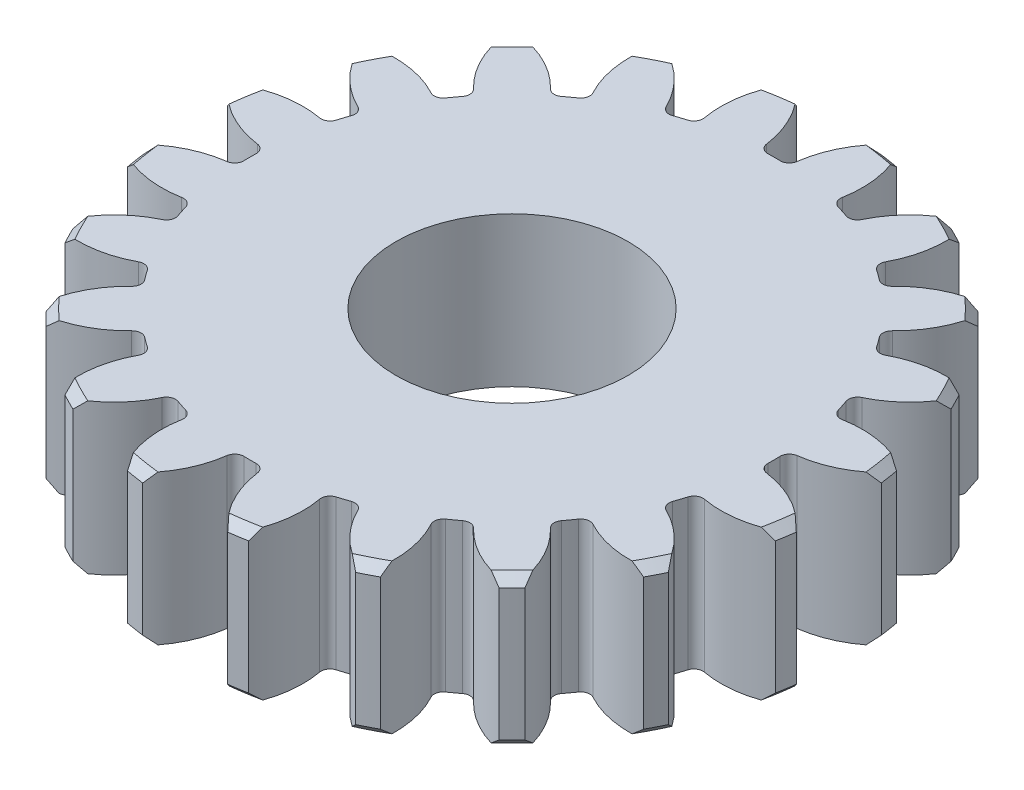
from build123d import *

# Parameters (mm, degrees)
SKETCH1_R                = 22
BOSS_EXTRUDE1_DEPTH      = 10
CUT_EXTRUDE1_DEPTH       = 10
FILLET1_R                = 0.6
CHAMFER1_SIZE            = 0.6
CIRPATTERN1_COUNT        = 20
FILLET1_OF_CIRPATTERN1_R = 0.6
SKETCH3_R                = 7.75
CUT_EXTRUDE2_DEPTH       = 10


with BuildPart() as part:
    # Sketch1 → Boss-Extrude1 (new body)
    with BuildSketch(Plane(origin=(0, 0, 0), x_dir=(1, 0, 0), z_dir=(0, 1, 0))):
        with Locations(Location((0, 0, 0), (0, 0, 270))):
            Circle(SKETCH1_R)
    extrude(amount=BOSS_EXTRUDE1_DEPTH)

    # Sketch2 → Cut-Extrude1 (cut)
    with BuildSketch(Plane.XZ):
        with BuildLine():
            ThreePointArc((-2.83665719, 21.816355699), (-1.513028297, 19.811754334), (-0.962550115, 17.473508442))
            ThreePointArc((-0.962550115, 17.473508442), (0, 17.5), (0.962550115, 17.473508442))
            ThreePointArc((0.962550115, 17.473508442), (1.513028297, 19.811754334), (2.83665719, 21.816355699))
            ThreePointArc((2.83665719, 21.816355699), (0, 22), (-2.83665719, 21.816355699))
        make_face()
    cut_extrude1 = extrude(amount=-CUT_EXTRUDE1_DEPTH, mode=Mode.SUBTRACT)

    # Fillet1
    fillet1_edges = [part.edges().sort_by_distance(p)[0] for p in [
        (-0.962550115, 5, 17.473508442),
        (0.962550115, 5, 17.473508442),
    ]]
    fillet(fillet1_edges, radius=FILLET1_R)

    # Chamfer1
    chamfer1_edges = [part.edges().sort_by_distance(p)[0] for p in [
        (0, 0, -22),
        (0, 10, -22),
    ]]
    chamfer(chamfer1_edges, length=CHAMFER1_SIZE)

    # CirPattern1: Cut-Extrude1 ×20 about axis
    cirpattern1_axis = Axis((0, 0, 0), (0, 1, 0))
    for i in range(1, CIRPATTERN1_COUNT):
        add(cut_extrude1.rotate(cirpattern1_axis, i * 360 / CIRPATTERN1_COUNT), mode=Mode.SUBTRACT)

    # Fillet1 of CirPattern1
    fillet1_of_cirpattern1_edges = [part.edges().sort_by_distance(p)[0] for p in [
        (4.4841715, 5, 16.91573841),
        (6.31505062, 5, 16.320849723),
        (9.491951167, 5, 14.702138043),
        (11.049389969, 5, 13.570592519),
        (13.570592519, 5, 11.049389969),
        (14.702138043, 5, 9.491951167),
        (16.320849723, 5, 6.31505062),
        (16.91573841, 5, 4.4841715),
        (17.473508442, 5, 0.962550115),
        (17.473508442, 5, -0.962550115),
        (16.91573841, 5, -4.4841715),
        (16.320849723, 5, -6.31505062),
        (14.702138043, 5, -9.491951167),
        (13.570592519, 5, -11.049389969),
        (11.049389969, 5, -13.570592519),
        (9.491951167, 5, -14.702138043),
        (6.31505062, 5, -16.320849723),
        (4.4841715, 5, -16.91573841),
        (0.962550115, 5, -17.473508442),
        (-0.962550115, 5, -17.473508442),
        (-4.4841715, 5, -16.91573841),
        (-6.31505062, 5, -16.320849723),
        (-9.491951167, 5, -14.702138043),
        (-11.049389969, 5, -13.570592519),
        (-13.570592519, 5, -11.049389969),
        (-14.702138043, 5, -9.491951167),
        (-16.320849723, 5, -6.31505062),
        (-16.91573841, 5, -4.4841715),
        (-17.473508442, 5, -0.962550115),
        (-17.473508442, 5, 0.962550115),
        (-16.91573841, 5, 4.4841715),
        (-16.320849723, 5, 6.31505062),
        (-14.702138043, 5, 9.491951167),
        (-13.570592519, 5, 11.049389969),
        (-11.049389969, 5, 13.570592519),
        (-9.491951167, 5, 14.702138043),
        (-6.31505062, 5, 16.320849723),
        (-4.4841715, 5, 16.91573841),
    ]]
    fillet(fillet1_of_cirpattern1_edges, radius=FILLET1_OF_CIRPATTERN1_R)

    # Sketch3 → Cut-Extrude2 (cut)
    with BuildSketch(Plane.XZ):
        with Locations(Location((0, 0, 0), (0, 0, 270))):
            Circle(SKETCH3_R)
    extrude(amount=-CUT_EXTRUDE2_DEPTH, mode=Mode.SUBTRACT)


solid = part.part
